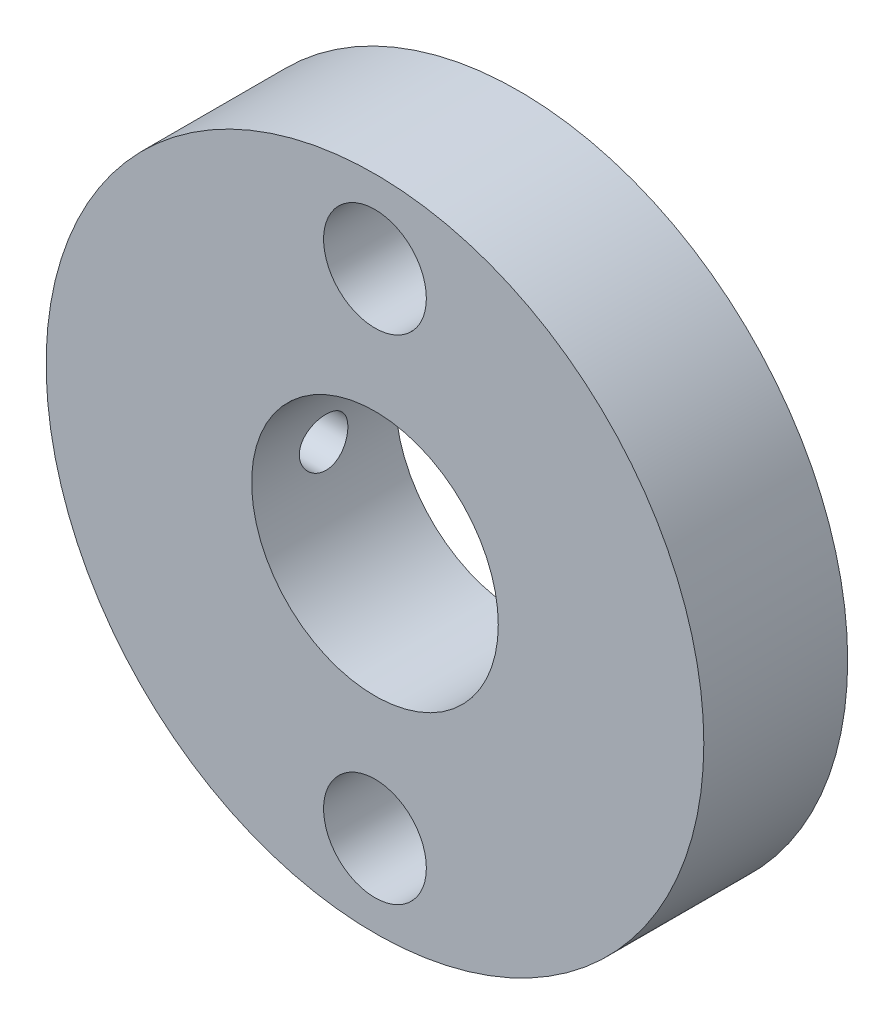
ISO-10303-21;
HEADER;
FILE_DESCRIPTION(('STEP AP214'),'2;1');
FILE_NAME('part.step','',(''),(''),'','','');
FILE_SCHEMA(('AUTOMOTIVE_DESIGN { 1 0 10303 214 1 1 1 1 }'));
ENDSEC;
DATA;
#1=APPLICATION_CONTEXT('core data for automotive mechanical design processes');
#2=APPLICATION_PROTOCOL_DEFINITION('international standard','automotive_design',2000,#1);
#3=PRODUCT_CONTEXT('',#1,'mechanical');
#4=PRODUCT('Part','Part','',(#3));
#5=PRODUCT_RELATED_PRODUCT_CATEGORY('part','',(#4));
#6=PRODUCT_DEFINITION_FORMATION('','',#4);
#7=PRODUCT_DEFINITION_CONTEXT('part definition',#1,'design');
#8=PRODUCT_DEFINITION('design','',#6,#7);
#9=PRODUCT_DEFINITION_SHAPE('','',#8);
#10=(LENGTH_UNIT() NAMED_UNIT(*) SI_UNIT(.MILLI.,.METRE.));
#11=(NAMED_UNIT(*) PLANE_ANGLE_UNIT() SI_UNIT($,.RADIAN.));
#12=(NAMED_UNIT(*) SI_UNIT($,.STERADIAN.) SOLID_ANGLE_UNIT());
#13=UNCERTAINTY_MEASURE_WITH_UNIT(LENGTH_MEASURE(1.E-05),#10,'distance_accuracy_value','');
#14=(GEOMETRIC_REPRESENTATION_CONTEXT(3) GLOBAL_UNCERTAINTY_ASSIGNED_CONTEXT((#13)) GLOBAL_UNIT_ASSIGNED_CONTEXT((#10,
#11,#12)) REPRESENTATION_CONTEXT('',''));
#15=CARTESIAN_POINT('',(0.,0.,0.));
#16=DIRECTION('',(0.,0.,1.));
#17=DIRECTION('',(1.,0.,0.));
#18=AXIS2_PLACEMENT_3D('',#15,#16,#17);
#19=CARTESIAN_POINT('',(19.05,49.9310116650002,22.225));
#20=DIRECTION('',(0.,0.,-1.));
#21=DIRECTION('',(-1.,0.,0.));
#22=AXIS2_PLACEMENT_3D('',#19,#20,#21);
#23=CYLINDRICAL_SURFACE('',#22,50.8);
#24=CARTESIAN_POINT('',(19.05,49.9310116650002,22.225));
#25=DIRECTION('',(0.,0.,1.));
#26=DIRECTION('',(1.,0.,0.));
#27=AXIS2_PLACEMENT_3D('',#24,#25,#26);
#28=CIRCLE('',#27,50.8);
#29=CARTESIAN_POINT('',(69.85,49.9310116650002,22.225));
#30=VERTEX_POINT('',#29);
#31=EDGE_CURVE('E10',#30,#30,#28,.T.);
#32=ORIENTED_EDGE('',*,*,#31,.F.);
#33=EDGE_LOOP('',(#32));
#34=FACE_BOUND('',#33,.T.);
#35=CARTESIAN_POINT('',(19.05,49.9310116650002,0.));
#36=DIRECTION('',(0.,0.,1.));
#37=DIRECTION('',(1.,0.,0.));
#38=AXIS2_PLACEMENT_3D('',#35,#36,#37);
#39=CIRCLE('',#38,50.8);
#40=CARTESIAN_POINT('',(69.85,49.9310116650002,0.));
#41=VERTEX_POINT('',#40);
#42=EDGE_CURVE('E55',#41,#41,#39,.T.);
#43=ORIENTED_EDGE('',*,*,#42,.T.);
#44=EDGE_LOOP('',(#43));
#45=FACE_BOUND('',#44,.T.);
#46=CARTESIAN_POINT('',(-31.75,49.9310116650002,14.8625));
#47=CARTESIAN_POINT('',(-31.7499981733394,50.1413435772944,14.862490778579));
#48=CARTESIAN_POINT('',(-31.7486797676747,50.3518206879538,14.844744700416));
#49=CARTESIAN_POINT('',(-31.7435471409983,50.7669572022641,14.7742101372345));
#50=CARTESIAN_POINT('',(-31.739730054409,50.9716096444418,14.7213814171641));
#51=CARTESIAN_POINT('',(-31.7300316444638,51.3690238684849,14.582212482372));
#52=CARTESIAN_POINT('',(-31.7241514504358,51.5617920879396,14.4958905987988));
#53=CARTESIAN_POINT('',(-31.7109872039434,51.9300547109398,14.2922170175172));
#54=CARTESIAN_POINT('',(-31.7037034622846,52.1055529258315,14.174872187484));
#55=CARTESIAN_POINT('',(-31.6885335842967,52.4346986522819,13.9122247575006));
#56=CARTESIAN_POINT('',(-31.6806463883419,52.588306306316,13.7668722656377));
#57=CARTESIAN_POINT('',(-31.6651674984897,52.8689690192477,13.4524400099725));
#58=CARTESIAN_POINT('',(-31.6575758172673,52.9960229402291,13.2833592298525));
#59=CARTESIAN_POINT('',(-31.6435355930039,53.2201018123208,12.9260347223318));
#60=CARTESIAN_POINT('',(-31.6370883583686,53.317092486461,12.7377694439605));
#61=CARTESIAN_POINT('',(-31.6260782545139,53.4780725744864,12.3475706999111));
#62=CARTESIAN_POINT('',(-31.6215153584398,53.5420624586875,12.1456374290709));
#63=CARTESIAN_POINT('',(-31.6147988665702,53.6351108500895,11.7342284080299));
#64=CARTESIAN_POINT('',(-31.6126408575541,53.6642333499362,11.5247672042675));
#65=CARTESIAN_POINT('',(-31.6109643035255,53.686917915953,11.103919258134));
#66=CARTESIAN_POINT('',(-31.6114457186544,53.6804805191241,10.8925325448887));
#67=CARTESIAN_POINT('',(-31.6149896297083,53.6322810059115,10.4742713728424));
#68=CARTESIAN_POINT('',(-31.6180470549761,53.5905882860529,10.2673888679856));
#69=CARTESIAN_POINT('',(-31.6263904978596,53.4731693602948,9.86356652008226));
#70=CARTESIAN_POINT('',(-31.6316765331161,53.3974428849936,9.6666267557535));
#71=CARTESIAN_POINT('',(-31.6438873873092,53.2140278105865,9.28805822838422));
#72=CARTESIAN_POINT('',(-31.6508138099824,53.10630790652,9.10644468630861));
#73=CARTESIAN_POINT('',(-31.6655234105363,52.8619863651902,8.76385036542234));
#74=CARTESIAN_POINT('',(-31.6733066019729,52.7253842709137,8.60286991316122));
#75=CARTESIAN_POINT('',(-31.6888752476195,52.4267859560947,8.30570778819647));
#76=CARTESIAN_POINT('',(-31.6966606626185,52.264729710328,8.16958642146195));
#77=CARTESIAN_POINT('',(-31.7113386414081,51.9200331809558,7.92647217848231));
#78=CARTESIAN_POINT('',(-31.7182312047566,51.7373928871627,7.81947931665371));
#79=CARTESIAN_POINT('',(-31.7303477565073,51.3566748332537,7.63766363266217));
#80=CARTESIAN_POINT('',(-31.7355716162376,51.1585958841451,7.56284329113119));
#81=CARTESIAN_POINT('',(-31.7437605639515,50.7526404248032,7.44753778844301));
#82=CARTESIAN_POINT('',(-31.7467256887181,50.5447640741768,7.4070520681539));
#83=CARTESIAN_POINT('',(-31.750058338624,50.1256376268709,7.36164022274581));
#84=CARTESIAN_POINT('',(-31.7504319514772,49.9143966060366,7.35663075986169));
#85=CARTESIAN_POINT('',(-31.7485557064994,49.4940775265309,7.38209559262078));
#86=CARTESIAN_POINT('',(-31.7463058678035,49.2849994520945,7.41256962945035));
#87=CARTESIAN_POINT('',(-31.7394397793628,48.8751774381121,7.50806737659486));
#88=CARTESIAN_POINT('',(-31.7348261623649,48.6744244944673,7.57305265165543));
#89=CARTESIAN_POINT('',(-31.7237511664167,48.286672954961,7.73568903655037));
#90=CARTESIAN_POINT('',(-31.7172897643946,48.0996745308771,7.83334055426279));
#91=CARTESIAN_POINT('',(-31.7032291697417,47.7443597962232,8.05874822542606));
#92=CARTESIAN_POINT('',(-31.6956278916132,47.5760787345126,8.18655981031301));
#93=CARTESIAN_POINT('',(-31.6801492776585,47.2633309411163,8.46857914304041));
#94=CARTESIAN_POINT('',(-31.6722719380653,47.1188645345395,8.62278725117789));
#95=CARTESIAN_POINT('',(-31.6571111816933,46.8575628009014,8.95358284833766));
#96=CARTESIAN_POINT('',(-31.649828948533,46.7407817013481,9.13021323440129));
#97=CARTESIAN_POINT('',(-31.636698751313,46.5385369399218,9.5006249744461));
#98=CARTESIAN_POINT('',(-31.6308507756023,46.4530730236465,9.6944061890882));
#99=CARTESIAN_POINT('',(-31.6212572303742,46.3159817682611,10.0934238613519));
#100=CARTESIAN_POINT('',(-31.6175095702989,46.2643207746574,10.298648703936));
#101=CARTESIAN_POINT('',(-31.6125335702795,46.1961920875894,10.7148882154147));
#102=CARTESIAN_POINT('',(-31.6113051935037,46.1797238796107,10.9259027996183));
#103=CARTESIAN_POINT('',(-31.611507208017,46.1824536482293,11.3471928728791));
#104=CARTESIAN_POINT('',(-31.6129312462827,46.2015664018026,11.557468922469));
#105=CARTESIAN_POINT('',(-31.6182641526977,46.274738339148,11.9718166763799));
#106=CARTESIAN_POINT('',(-31.6221730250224,46.3287975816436,12.1758883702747));
#107=CARTESIAN_POINT('',(-31.6320335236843,46.4703074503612,12.5720434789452));
#108=CARTESIAN_POINT('',(-31.6379850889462,46.5577570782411,12.7641272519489));
#109=CARTESIAN_POINT('',(-31.6512603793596,46.7635550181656,13.1308995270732));
#110=CARTESIAN_POINT('',(-31.658584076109,46.8819026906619,13.3055883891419));
#111=CARTESIAN_POINT('',(-31.6737991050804,47.1464560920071,13.6330469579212));
#112=CARTESIAN_POINT('',(-31.6816916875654,47.2927244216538,13.7857660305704));
#113=CARTESIAN_POINT('',(-31.6971439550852,47.6088637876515,14.0645413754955));
#114=CARTESIAN_POINT('',(-31.7047035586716,47.7787405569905,14.1905911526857));
#115=CARTESIAN_POINT('',(-31.7186488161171,48.1375353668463,14.4125808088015));
#116=CARTESIAN_POINT('',(-31.7250326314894,48.326482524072,14.5084736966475));
#117=CARTESIAN_POINT('',(-31.7358842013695,48.7177096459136,14.6670534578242));
#118=CARTESIAN_POINT('',(-31.7403541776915,48.9199738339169,14.7297788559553));
#119=CARTESIAN_POINT('',(-31.7457151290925,49.2580464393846,14.8041063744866));
#120=CARTESIAN_POINT('',(-31.747314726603,49.3916749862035,14.825975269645));
#121=CARTESIAN_POINT('',(-31.7494577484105,49.6605195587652,14.8551750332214));
#122=CARTESIAN_POINT('',(-31.7500011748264,49.7957355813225,14.8625059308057));
#123=CARTESIAN_POINT('',(-31.75,49.9310116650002,14.8625));
#124=B_SPLINE_CURVE_WITH_KNOTS('',3,(#46,#47,#48,#49,#50,#51,#52,#53,#54,#55,#56,#57,#58,#59,
#60,#61,#62,#63,#64,#65,#66,#67,#68,#69,#70,#71,#72,#73,#74,#75,#76,#77,#78,#79,#80,#81,#82,#83,
#84,#85,#86,#87,#88,#89,#90,#91,#92,#93,#94,#95,#96,#97,#98,#99,#100,#101,#102,#103,#104,#105,
#106,#107,#108,#109,#110,#111,#112,#113,#114,#115,#116,#117,#118,#119,#120,#121,#122,#123),
.UNSPECIFIED.,.T.,.F.,(4,2,2,2,2,2,2,2,2,2,2,2,2,2,2,2,2,2,2,2,2,2,2,2,2,2,2,2,2,2,2,2,2,2,2,2,
2,2,4),(0.,0.630501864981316,1.26172808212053,1.89260930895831,2.52335099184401,
3.15522682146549,3.78712972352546,4.41975046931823,5.05236219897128,5.68381109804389,
6.31525046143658,6.94544978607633,7.57565409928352,8.20647709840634,8.8373100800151,
9.46965364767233,10.1019975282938,10.7343901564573,11.3667724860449,11.9976687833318,
12.6285604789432,13.2587510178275,13.8889494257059,14.5203152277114,15.1516896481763,
15.7842907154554,16.4168866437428,17.0488517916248,17.6808077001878,18.3112519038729,
18.9416971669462,19.5721235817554,20.2025369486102,20.8343807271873,21.4663782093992,
22.0993556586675,22.7315962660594,23.1371076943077,23.5426183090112),.UNSPECIFIED.);
#125=CARTESIAN_POINT('',(-31.75,49.9310116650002,14.8625));
#126=VERTEX_POINT('',#125);
#127=EDGE_CURVE('E82',#126,#126,#124,.T.);
#128=ORIENTED_EDGE('',*,*,#127,.F.);
#129=EDGE_LOOP('',(#128));
#130=FACE_BOUND('',#129,.T.);
#131=ADVANCED_FACE('F42',(#34,#45,#130),#23,.T.);
#132=CARTESIAN_POINT('',(19.05,49.9310116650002,-25.781));
#133=DIRECTION('',(0.,0.,1.));
#134=DIRECTION('',(1.,0.,0.));
#135=AXIS2_PLACEMENT_3D('',#132,#133,#134);
#136=CYLINDRICAL_SURFACE('',#135,19.05);
#137=CARTESIAN_POINT('',(19.05,49.9310116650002,22.225));
#138=DIRECTION('',(0.,0.,1.));
#139=DIRECTION('',(1.,0.,0.));
#140=AXIS2_PLACEMENT_3D('',#137,#138,#139);
#141=CIRCLE('',#140,19.05);
#142=CARTESIAN_POINT('',(38.1,49.9310116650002,22.225));
#143=VERTEX_POINT('',#142);
#144=EDGE_CURVE('E75',#143,#143,#141,.T.);
#145=ORIENTED_EDGE('',*,*,#144,.T.);
#146=EDGE_LOOP('',(#145));
#147=FACE_BOUND('',#146,.T.);
#148=CARTESIAN_POINT('',(19.05,49.9310116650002,0.));
#149=DIRECTION('',(0.,0.,1.));
#150=DIRECTION('',(1.,0.,0.));
#151=AXIS2_PLACEMENT_3D('',#148,#149,#150);
#152=CIRCLE('',#151,19.05);
#153=CARTESIAN_POINT('',(38.1,49.9310116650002,0.));
#154=VERTEX_POINT('',#153);
#155=EDGE_CURVE('E72',#154,#154,#152,.T.);
#156=ORIENTED_EDGE('',*,*,#155,.F.);
#157=EDGE_LOOP('',(#156));
#158=FACE_BOUND('',#157,.T.);
#159=CARTESIAN_POINT('',(0.,49.9310116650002,14.8625));
#160=CARTESIAN_POINT('',(3.82967835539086E-06,49.7225297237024,14.8624922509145));
#161=CARTESIAN_POINT('',(0.00345759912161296,49.5139490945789,14.845055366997));
#162=CARTESIAN_POINT('',(0.0169022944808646,49.1026789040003,14.7758212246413));
#163=CARTESIAN_POINT('',(0.0268984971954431,48.8999942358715,14.7239962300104));
#164=CARTESIAN_POINT('',(0.0523113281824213,48.506522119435,14.5876451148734));
#165=CARTESIAN_POINT('',(0.0677228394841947,48.3157236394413,14.5031498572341));
#166=CARTESIAN_POINT('',(0.10228896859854,47.9510256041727,14.3039473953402));
#167=CARTESIAN_POINT('',(0.121443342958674,47.7771249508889,14.1892421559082));
#168=CARTESIAN_POINT('',(0.161666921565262,47.448859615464,13.9312773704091));
#169=CARTESIAN_POINT('',(0.182756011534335,47.2947489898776,13.7876976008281));
#170=CARTESIAN_POINT('',(0.224326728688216,47.0126376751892,13.4767479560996));
#171=CARTESIAN_POINT('',(0.244808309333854,46.884638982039,13.3093762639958));
#172=CARTESIAN_POINT('',(0.283038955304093,46.6573099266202,12.9537746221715));
#173=CARTESIAN_POINT('',(0.300762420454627,46.5582414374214,12.7653742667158));
#174=CARTESIAN_POINT('',(0.331188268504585,46.3932623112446,12.3741958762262));
#175=CARTESIAN_POINT('',(0.34389113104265,46.3273485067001,12.1714192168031));
#176=CARTESIAN_POINT('',(0.362636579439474,46.2313721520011,11.7599738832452));
#177=CARTESIAN_POINT('',(0.368761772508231,46.2008645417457,11.5514128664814));
#178=CARTESIAN_POINT('',(0.373907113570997,46.1751844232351,11.1320495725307));
#179=CARTESIAN_POINT('',(0.372927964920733,46.1800084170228,10.9212475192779));
#180=CARTESIAN_POINT('',(0.364050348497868,46.224494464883,10.5066339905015));
#181=CARTESIAN_POINT('',(0.356253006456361,46.2636473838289,10.3027653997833));
#182=CARTESIAN_POINT('',(0.33477669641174,46.3748766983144,9.90454814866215));
#183=CARTESIAN_POINT('',(0.321097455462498,46.4469546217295,9.71019993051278));
#184=CARTESIAN_POINT('',(0.289294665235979,46.6224770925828,9.33506721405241));
#185=CARTESIAN_POINT('',(0.271142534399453,46.7261244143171,9.15438011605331));
#186=CARTESIAN_POINT('',(0.232457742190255,46.9617003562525,8.81277158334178));
#187=CARTESIAN_POINT('',(0.211924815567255,47.0936321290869,8.65185235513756));
#188=CARTESIAN_POINT('',(0.170353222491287,47.3847628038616,8.35140865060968));
#189=CARTESIAN_POINT('',(0.149311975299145,47.5443964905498,8.21230549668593));
#190=CARTESIAN_POINT('',(0.109422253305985,47.8849521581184,7.96278581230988));
#191=CARTESIAN_POINT('',(0.0905738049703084,48.0658743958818,7.85236962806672));
#192=CARTESIAN_POINT('',(0.057149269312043,48.4443320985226,7.66328435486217));
#193=CARTESIAN_POINT('',(0.0425795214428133,48.6418916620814,7.58466230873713));
#194=CARTESIAN_POINT('',(0.0194023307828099,49.047765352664,7.46184031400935));
#195=CARTESIAN_POINT('',(0.0107941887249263,49.2560782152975,7.4176363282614));
#196=CARTESIAN_POINT('',(0.000607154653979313,49.6739236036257,7.36549914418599));
#197=CARTESIAN_POINT('',(-0.00108350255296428,49.8833815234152,7.35698918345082));
#198=CARTESIAN_POINT('',(0.00244492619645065,50.3007266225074,7.37492991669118));
#199=CARTESIAN_POINT('',(0.00766363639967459,50.508613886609,7.40137870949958));
#200=CARTESIAN_POINT('',(0.0243545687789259,50.9150638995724,7.48800689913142));
#201=CARTESIAN_POINT('',(0.0357720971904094,51.1136919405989,7.54789141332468));
#202=CARTESIAN_POINT('',(0.0635852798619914,51.4980877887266,7.69936971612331));
#203=CARTESIAN_POINT('',(0.0799812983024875,51.6838546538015,7.79096582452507));
#204=CARTESIAN_POINT('',(0.116211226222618,52.039694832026,8.00452238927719));
#205=CARTESIAN_POINT('',(0.136083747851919,52.2095549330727,8.12683142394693));
#206=CARTESIAN_POINT('',(0.176969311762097,52.5265468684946,8.39787392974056));
#207=CARTESIAN_POINT('',(0.197982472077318,52.6736763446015,8.54661013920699));
#208=CARTESIAN_POINT('',(0.239156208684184,52.9432477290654,8.8689068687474));
#209=CARTESIAN_POINT('',(0.259299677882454,53.0652942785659,9.04280062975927));
#210=CARTESIAN_POINT('',(0.296095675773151,53.278446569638,9.40895964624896));
#211=CARTESIAN_POINT('',(0.312748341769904,53.369553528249,9.60122417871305));
#212=CARTESIAN_POINT('',(0.340540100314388,53.5176952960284,9.99771260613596));
#213=CARTESIAN_POINT('',(0.351707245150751,53.5749037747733,10.2018695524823));
#214=CARTESIAN_POINT('',(0.367324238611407,53.6541537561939,10.6171407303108));
#215=CARTESIAN_POINT('',(0.371774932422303,53.6761996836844,10.8282540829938));
#216=CARTESIAN_POINT('',(0.373409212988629,53.68433901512,11.2474783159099));
#217=CARTESIAN_POINT('',(0.370719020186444,53.6710568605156,11.4555768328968));
#218=CARTESIAN_POINT('',(0.358656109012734,53.6102923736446,11.866511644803));
#219=CARTESIAN_POINT('',(0.349283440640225,53.5628102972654,12.0693479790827));
#220=CARTESIAN_POINT('',(0.324967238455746,53.4352685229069,12.4636191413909));
#221=CARTESIAN_POINT('',(0.310036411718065,53.3552830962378,12.655078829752));
#222=CARTESIAN_POINT('',(0.276278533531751,53.1650758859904,13.0219591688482));
#223=CARTESIAN_POINT('',(0.25745116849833,53.0548516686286,13.1973785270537));
#224=CARTESIAN_POINT('',(0.217633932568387,52.8051531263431,13.530312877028));
#225=CARTESIAN_POINT('',(0.196613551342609,52.6652269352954,13.6874853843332));
#226=CARTESIAN_POINT('',(0.155000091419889,52.3610318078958,13.976326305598));
#227=CARTESIAN_POINT('',(0.134407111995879,52.1967572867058,14.1079888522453));
#228=CARTESIAN_POINT('',(0.0957242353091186,51.846539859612,14.3433225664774));
#229=CARTESIAN_POINT('',(0.0776616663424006,51.6603951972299,14.4466981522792));
#230=CARTESIAN_POINT('',(0.0463431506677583,51.273075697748,14.6205390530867));
#231=CARTESIAN_POINT('',(0.0330828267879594,51.07191475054,14.6910343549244));
#232=CARTESIAN_POINT('',(0.0154719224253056,50.713722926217,14.7832897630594));
#233=CARTESIAN_POINT('',(0.00970359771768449,50.5587457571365,14.8129412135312));
#234=CARTESIAN_POINT('',(0.00196624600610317,50.2462016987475,14.8525489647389));
#235=CARTESIAN_POINT('',(-2.89543657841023E-06,50.0886348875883,14.8625058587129));
#236=CARTESIAN_POINT('',(0.,49.9310116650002,14.8625));
#237=B_SPLINE_CURVE_WITH_KNOTS('',3,(#159,#160,#161,#162,#163,#164,#165,#166,#167,#168,#169,
#170,#171,#172,#173,#174,#175,#176,#177,#178,#179,#180,#181,#182,#183,#184,#185,#186,#187,#188,
#189,#190,#191,#192,#193,#194,#195,#196,#197,#198,#199,#200,#201,#202,#203,#204,#205,#206,#207,
#208,#209,#210,#211,#212,#213,#214,#215,#216,#217,#218,#219,#220,#221,#222,#223,#224,#225,#226,
#227,#228,#229,#230,#231,#232,#233,#234,#235,#236),.UNSPECIFIED.,.T.,.F.,(4,2,2,2,2,2,2,2,2,2,2,
2,2,2,2,2,2,2,2,2,2,2,2,2,2,2,2,2,2,2,2,2,2,2,2,2,2,2,4),(0.,0.62486924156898,1.2502430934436,
1.87502760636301,2.49977149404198,3.13186933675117,3.76401547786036,4.4017179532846,
5.03935949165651,5.66889588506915,6.29836995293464,6.9186632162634,7.53898526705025,
8.1633788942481,8.78784215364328,9.42317879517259,10.0585231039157,10.6948040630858,
11.3310103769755,11.9568959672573,12.5827475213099,13.2031647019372,13.8236272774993,
14.4514780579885,15.0793939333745,15.7165544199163,16.3536898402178,16.9875321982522,
17.6212947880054,18.2439300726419,18.866560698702,19.4877765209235,20.1090423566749,
20.7405408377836,21.3721843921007,22.0101959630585,22.6476245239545,23.1200724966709,
23.5925062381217),.UNSPECIFIED.);
#238=CARTESIAN_POINT('',(0.,49.9310116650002,14.8625));
#239=VERTEX_POINT('',#238);
#240=EDGE_CURVE('E46',#239,#239,#237,.T.);
#241=ORIENTED_EDGE('',*,*,#240,.F.);
#242=EDGE_LOOP('',(#241));
#243=FACE_BOUND('',#242,.T.);
#244=ADVANCED_FACE('F111',(#147,#158,#243),#136,.F.);
#245=CARTESIAN_POINT('',(19.05,11.8310116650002,0.));
#246=DIRECTION('',(0.,0.,1.));
#247=DIRECTION('',(1.,0.,0.));
#248=AXIS2_PLACEMENT_3D('',#245,#246,#247);
#249=CYLINDRICAL_SURFACE('',#248,4.925);
#250=CARTESIAN_POINT('',(19.05,11.8310116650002,0.));
#251=DIRECTION('',(0.,0.,1.));
#252=DIRECTION('',(1.,0.,0.));
#253=AXIS2_PLACEMENT_3D('',#250,#251,#252);
#254=CIRCLE('',#253,4.925);
#255=CARTESIAN_POINT('',(23.975,11.8310116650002,0.));
#256=VERTEX_POINT('',#255);
#257=EDGE_CURVE('E63',#256,#256,#254,.T.);
#258=ORIENTED_EDGE('',*,*,#257,.F.);
#259=EDGE_LOOP('',(#258));
#260=FACE_BOUND('',#259,.T.);
#261=CARTESIAN_POINT('',(19.05,11.8310116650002,6.35));
#262=DIRECTION('',(0.,0.,1.));
#263=DIRECTION('',(1.,0.,0.));
#264=AXIS2_PLACEMENT_3D('',#261,#262,#263);
#265=CIRCLE('',#264,4.925);
#266=CARTESIAN_POINT('',(23.975,11.8310116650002,6.35));
#267=VERTEX_POINT('',#266);
#268=EDGE_CURVE('E69',#267,#267,#265,.F.);
#269=ORIENTED_EDGE('',*,*,#268,.F.);
#270=EDGE_LOOP('',(#269));
#271=FACE_BOUND('',#270,.T.);
#272=ADVANCED_FACE('F107',(#260,#271),#249,.F.);
#273=CARTESIAN_POINT('',(19.05,88.0310116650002,0.));
#274=DIRECTION('',(0.,0.,1.));
#275=DIRECTION('',(1.,0.,0.));
#276=AXIS2_PLACEMENT_3D('',#273,#274,#275);
#277=CYLINDRICAL_SURFACE('',#276,4.925);
#278=CARTESIAN_POINT('',(19.05,88.0310116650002,0.));
#279=DIRECTION('',(0.,0.,1.));
#280=DIRECTION('',(1.,0.,0.));
#281=AXIS2_PLACEMENT_3D('',#278,#279,#280);
#282=CIRCLE('',#281,4.925);
#283=CARTESIAN_POINT('',(23.975,88.0310116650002,0.));
#284=VERTEX_POINT('',#283);
#285=EDGE_CURVE('E60',#284,#284,#282,.T.);
#286=ORIENTED_EDGE('',*,*,#285,.F.);
#287=EDGE_LOOP('',(#286));
#288=FACE_BOUND('',#287,.T.);
#289=CARTESIAN_POINT('',(19.05,88.0310116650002,6.35));
#290=DIRECTION('',(0.,0.,1.));
#291=DIRECTION('',(1.,0.,0.));
#292=AXIS2_PLACEMENT_3D('',#289,#290,#291);
#293=CIRCLE('',#292,4.925);
#294=CARTESIAN_POINT('',(23.975,88.0310116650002,6.35));
#295=VERTEX_POINT('',#294);
#296=EDGE_CURVE('E66',#295,#295,#293,.F.);
#297=ORIENTED_EDGE('',*,*,#296,.F.);
#298=EDGE_LOOP('',(#297));
#299=FACE_BOUND('',#298,.T.);
#300=ADVANCED_FACE('F110',(#288,#299),#277,.F.);
#301=CARTESIAN_POINT('',(19.05,49.9310116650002,22.225));
#302=DIRECTION('',(0.,0.,1.));
#303=DIRECTION('',(1.,0.,0.));
#304=AXIS2_PLACEMENT_3D('',#301,#302,#303);
#305=PLANE('',#304);
#306=ORIENTED_EDGE('',*,*,#144,.F.);
#307=EDGE_LOOP('',(#306));
#308=FACE_BOUND('',#307,.T.);
#309=CARTESIAN_POINT('',(19.05,88.0310116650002,22.225));
#310=DIRECTION('',(0.,0.,1.));
#311=DIRECTION('',(1.,0.,0.));
#312=AXIS2_PLACEMENT_3D('',#309,#310,#311);
#313=CIRCLE('',#312,7.9375);
#314=CARTESIAN_POINT('',(26.9875,88.0310116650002,22.225));
#315=VERTEX_POINT('',#314);
#316=EDGE_CURVE('E94',#315,#315,#313,.T.);
#317=ORIENTED_EDGE('',*,*,#316,.F.);
#318=EDGE_LOOP('',(#317));
#319=FACE_BOUND('',#318,.T.);
#320=CARTESIAN_POINT('',(19.05,11.8310116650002,22.225));
#321=DIRECTION('',(0.,0.,1.));
#322=DIRECTION('',(1.,0.,0.));
#323=AXIS2_PLACEMENT_3D('',#320,#321,#322);
#324=CIRCLE('',#323,7.9375);
#325=CARTESIAN_POINT('',(26.9875,11.8310116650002,22.225));
#326=VERTEX_POINT('',#325);
#327=EDGE_CURVE('E79',#326,#326,#324,.T.);
#328=ORIENTED_EDGE('',*,*,#327,.F.);
#329=EDGE_LOOP('',(#328));
#330=FACE_BOUND('',#329,.T.);
#331=ORIENTED_EDGE('',*,*,#31,.T.);
#332=EDGE_LOOP('',(#331));
#333=FACE_BOUND('',#332,.T.);
#334=ADVANCED_FACE('F157',(#308,#319,#330,#333),#305,.T.);
#335=CARTESIAN_POINT('',(19.05,49.9310116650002,0.));
#336=DIRECTION('',(0.,0.,1.));
#337=DIRECTION('',(1.,0.,0.));
#338=AXIS2_PLACEMENT_3D('',#335,#336,#337);
#339=PLANE('',#338);
#340=ORIENTED_EDGE('',*,*,#155,.T.);
#341=EDGE_LOOP('',(#340));
#342=FACE_BOUND('',#341,.T.);
#343=ORIENTED_EDGE('',*,*,#285,.T.);
#344=EDGE_LOOP('',(#343));
#345=FACE_BOUND('',#344,.T.);
#346=ORIENTED_EDGE('',*,*,#257,.T.);
#347=EDGE_LOOP('',(#346));
#348=FACE_BOUND('',#347,.T.);
#349=ORIENTED_EDGE('',*,*,#42,.F.);
#350=EDGE_LOOP('',(#349));
#351=FACE_BOUND('',#350,.T.);
#352=ADVANCED_FACE('F104',(#342,#345,#348,#351),#339,.F.);
#353=CARTESIAN_POINT('',(19.05,88.0310116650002,6.35));
#354=DIRECTION('',(0.,0.,1.));
#355=DIRECTION('',(1.,0.,0.));
#356=AXIS2_PLACEMENT_3D('',#353,#354,#355);
#357=PLANE('',#356);
#358=CARTESIAN_POINT('',(19.05,88.0310116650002,6.35));
#359=DIRECTION('',(0.,0.,1.));
#360=DIRECTION('',(1.,0.,0.));
#361=AXIS2_PLACEMENT_3D('',#358,#359,#360);
#362=CIRCLE('',#361,7.9375);
#363=CARTESIAN_POINT('',(26.9875,88.0310116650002,6.35));
#364=VERTEX_POINT('',#363);
#365=EDGE_CURVE('E70',#364,#364,#362,.T.);
#366=ORIENTED_EDGE('',*,*,#365,.T.);
#367=EDGE_LOOP('',(#366));
#368=FACE_BOUND('',#367,.T.);
#369=ORIENTED_EDGE('',*,*,#296,.T.);
#370=EDGE_LOOP('',(#369));
#371=FACE_BOUND('',#370,.T.);
#372=ADVANCED_FACE('F128',(#368,#371),#357,.T.);
#373=CARTESIAN_POINT('',(19.05,88.0310116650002,6.35));
#374=DIRECTION('',(0.,0.,1.));
#375=DIRECTION('',(1.,0.,0.));
#376=AXIS2_PLACEMENT_3D('',#373,#374,#375);
#377=CYLINDRICAL_SURFACE('',#376,7.9375);
#378=ORIENTED_EDGE('',*,*,#365,.F.);
#379=EDGE_LOOP('',(#378));
#380=FACE_BOUND('',#379,.T.);
#381=ORIENTED_EDGE('',*,*,#316,.T.);
#382=EDGE_LOOP('',(#381));
#383=FACE_BOUND('',#382,.T.);
#384=ADVANCED_FACE('F118',(#380,#383),#377,.F.);
#385=CARTESIAN_POINT('',(19.05,11.8310116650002,6.35));
#386=DIRECTION('',(0.,0.,1.));
#387=DIRECTION('',(1.,0.,0.));
#388=AXIS2_PLACEMENT_3D('',#385,#386,#387);
#389=PLANE('',#388);
#390=CARTESIAN_POINT('',(19.05,11.8310116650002,6.35));
#391=DIRECTION('',(0.,0.,1.));
#392=DIRECTION('',(1.,0.,0.));
#393=AXIS2_PLACEMENT_3D('',#390,#391,#392);
#394=CIRCLE('',#393,7.9375);
#395=CARTESIAN_POINT('',(26.9875,11.8310116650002,6.35));
#396=VERTEX_POINT('',#395);
#397=EDGE_CURVE('E74',#396,#396,#394,.T.);
#398=ORIENTED_EDGE('',*,*,#397,.T.);
#399=EDGE_LOOP('',(#398));
#400=FACE_BOUND('',#399,.T.);
#401=ORIENTED_EDGE('',*,*,#268,.T.);
#402=EDGE_LOOP('',(#401));
#403=FACE_BOUND('',#402,.T.);
#404=ADVANCED_FACE('F115',(#400,#403),#389,.T.);
#405=CARTESIAN_POINT('',(19.05,11.8310116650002,6.35));
#406=DIRECTION('',(0.,0.,1.));
#407=DIRECTION('',(1.,0.,0.));
#408=AXIS2_PLACEMENT_3D('',#405,#406,#407);
#409=CYLINDRICAL_SURFACE('',#408,7.9375);
#410=ORIENTED_EDGE('',*,*,#397,.F.);
#411=EDGE_LOOP('',(#410));
#412=FACE_BOUND('',#411,.T.);
#413=ORIENTED_EDGE('',*,*,#327,.T.);
#414=EDGE_LOOP('',(#413));
#415=FACE_BOUND('',#414,.T.);
#416=ADVANCED_FACE('F117',(#412,#415),#409,.F.);
#417=CARTESIAN_POINT('',(14.986,49.9310116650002,11.1125));
#418=DIRECTION('',(-1.,0.,0.));
#419=DIRECTION('',(0.,0.,1.));
#420=AXIS2_PLACEMENT_3D('',#417,#418,#419);
#421=CYLINDRICAL_SURFACE('',#420,3.75);
#422=ORIENTED_EDGE('',*,*,#240,.T.);
#423=EDGE_LOOP('',(#422));
#424=FACE_BOUND('',#423,.T.);
#425=ORIENTED_EDGE('',*,*,#127,.T.);
#426=EDGE_LOOP('',(#425));
#427=FACE_BOUND('',#426,.T.);
#428=ADVANCED_FACE('F125',(#424,#427),#421,.F.);
#429=CLOSED_SHELL('',(#131,#244,#272,#300,#334,#352,#372,#384,#404,#416,#428));
#430=MANIFOLD_SOLID_BREP('B2',#429);
#431=ADVANCED_BREP_SHAPE_REPRESENTATION('',(#18,#430),#14);
#432=SHAPE_DEFINITION_REPRESENTATION(#9,#431);
ENDSEC;
END-ISO-10303-21;
